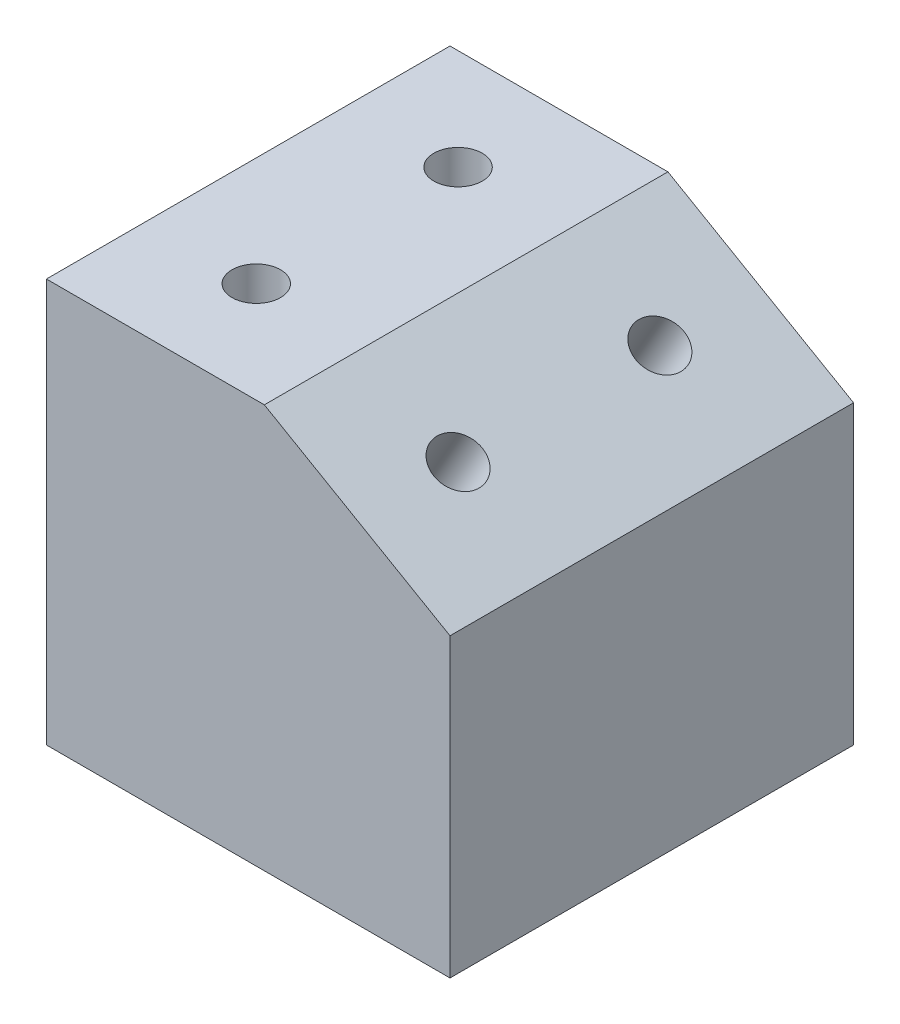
from build123d import *

# Parameters (mm, degrees)
AUFSATZ_LINEAR_AUSTRAGEN1_DEPTH                     = 50
F_6_0_6_DURCHMESSER_BOHRUNG2_D                      = 6
F_6_0_6_DURCHMESSER_BOHRUNG2_DEPTH                  = 30
F_6_0_6_DURCHMESSER_BOHRUNG2_TIP                    = 1.802581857
F_6_0_6_DURCHMESSER_BOHRUNG1_D                      = 6
F_6_0_6_DURCHMESSER_BOHRUNG1_DEPTH                  = 26.974349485
F_6_0_6_DURCHMESSER_BOHRUNG1_TIP                    = 1.802581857
STIRNSENKUNG_F_R_M1_6_FLACHKOPFSCHRAUBE_D           = 8
STIRNSENKUNG_F_R_M1_6_FLACHKOPFSCHRAUBE_DEPTH       = 33.012825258
STIRNSENKUNG_F_R_M1_6_FLACHKOPFSCHRAUBE_CBORE_D     = 12
STIRNSENKUNG_F_R_M1_6_FLACHKOPFSCHRAUBE_CBORE_DEPTH = 1.2
STIRNSENKUNG_F_R_M1_6_FLACHKOPFSCHRAUBE_TIP         = 2.403442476
M8_GEWINDEBOHRUNG1_D                                = 6.8
M8_GEWINDEBOHRUNG1_DEPTH                            = 16
M8_GEWINDEBOHRUNG1_TIP                              = 2.042926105


with BuildPart() as part:
    # Skizze1 → Aufsatz-Linear austragen1 (new body)
    with BuildSketch(Plane.XY):
        Polygon((2, 25), (25, 11.720943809), (25, -25), (-25, -25), (-25, 25), align=None)
    extrude(amount=AUFSATZ_LINEAR_AUSTRAGEN1_DEPTH)

    # 6.0 _6_ Durchmesser Bohrung2
    with Locations(Plane(origin=(0, 25, 0), x_dir=(-1, 0, 0), z_dir=(0, 1, 0))):
        with Locations((11.5, 37.5), (11.5, 12.5)):
            Hole(F_6_0_6_DURCHMESSER_BOHRUNG2_D / 2, depth=F_6_0_6_DURCHMESSER_BOHRUNG2_DEPTH)
            with Locations((0, 0, -(F_6_0_6_DURCHMESSER_BOHRUNG2_DEPTH + F_6_0_6_DURCHMESSER_BOHRUNG2_TIP / 2))):  # 118° drill point
                Cone(0, F_6_0_6_DURCHMESSER_BOHRUNG2_D / 2, F_6_0_6_DURCHMESSER_BOHRUNG2_TIP, mode=Mode.SUBTRACT)

    # 6.0 _6_ Durchmesser Bohrung1
    with Locations(Plane(origin=(11.325317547, 19.616025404, 0), x_dir=(-0.866025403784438, 0.5000000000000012, 0), z_dir=(0.5000000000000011, 0.8660254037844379, 0))):
        with Locations((-2.511106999, 12.5), (-2.511106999, 37.5)):
            Hole(F_6_0_6_DURCHMESSER_BOHRUNG1_D / 2, depth=F_6_0_6_DURCHMESSER_BOHRUNG1_DEPTH)
            with Locations((0, 0, -(F_6_0_6_DURCHMESSER_BOHRUNG1_DEPTH + F_6_0_6_DURCHMESSER_BOHRUNG1_TIP / 2))):  # 118° drill point
                Cone(0, F_6_0_6_DURCHMESSER_BOHRUNG1_D / 2, F_6_0_6_DURCHMESSER_BOHRUNG1_TIP, mode=Mode.SUBTRACT)

    # Stirnsenkung f_r M1.6 Flachkopfschraube
    with Locations(Plane.ZY.offset(25)):
        with Locations((37.5, -5), (12.5, -5)):
            CounterBoreHole(STIRNSENKUNG_F_R_M1_6_FLACHKOPFSCHRAUBE_D / 2, STIRNSENKUNG_F_R_M1_6_FLACHKOPFSCHRAUBE_CBORE_D / 2, STIRNSENKUNG_F_R_M1_6_FLACHKOPFSCHRAUBE_CBORE_DEPTH, depth=STIRNSENKUNG_F_R_M1_6_FLACHKOPFSCHRAUBE_DEPTH)
            with Locations((0, 0, -(STIRNSENKUNG_F_R_M1_6_FLACHKOPFSCHRAUBE_DEPTH + STIRNSENKUNG_F_R_M1_6_FLACHKOPFSCHRAUBE_TIP / 2))):  # 118° drill point
                Cone(0, STIRNSENKUNG_F_R_M1_6_FLACHKOPFSCHRAUBE_D / 2, STIRNSENKUNG_F_R_M1_6_FLACHKOPFSCHRAUBE_TIP, mode=Mode.SUBTRACT)

    # M8 Gewindebohrung1
    with Locations(Plane.ZY.offset(25)):
        with Locations((5, 5), (45, 5), (5, -15), (45, -15)):
            Hole(M8_GEWINDEBOHRUNG1_D / 2, depth=M8_GEWINDEBOHRUNG1_DEPTH)
            with Locations((0, 0, -(M8_GEWINDEBOHRUNG1_DEPTH + M8_GEWINDEBOHRUNG1_TIP / 2))):  # 118° drill point
                Cone(0, M8_GEWINDEBOHRUNG1_D / 2, M8_GEWINDEBOHRUNG1_TIP, mode=Mode.SUBTRACT)


solid = part.part
